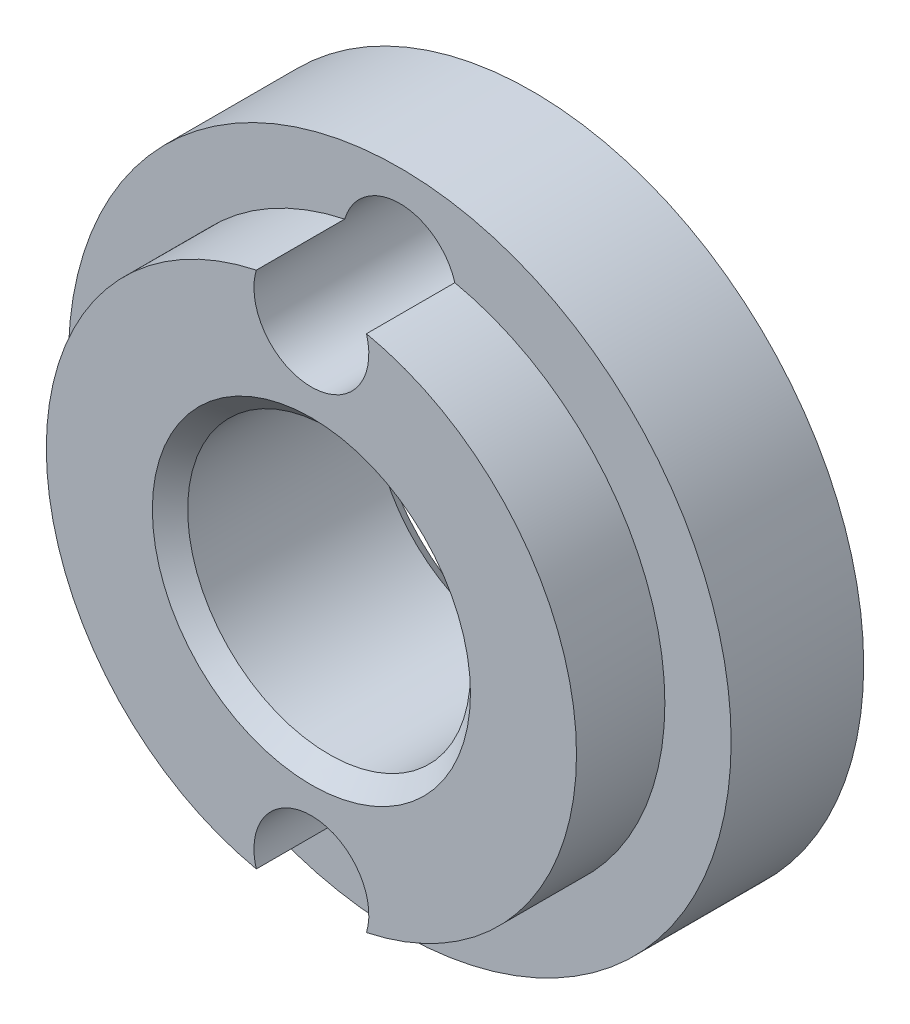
ISO-10303-21;
HEADER;
FILE_DESCRIPTION(('STEP AP214'),'2;1');
FILE_NAME('part.step','',(''),(''),'','','');
FILE_SCHEMA(('AUTOMOTIVE_DESIGN { 1 0 10303 214 1 1 1 1 }'));
ENDSEC;
DATA;
#1=APPLICATION_CONTEXT('core data for automotive mechanical design processes');
#2=APPLICATION_PROTOCOL_DEFINITION('international standard','automotive_design',2000,#1);
#3=PRODUCT_CONTEXT('',#1,'mechanical');
#4=PRODUCT('Part','Part','',(#3));
#5=PRODUCT_RELATED_PRODUCT_CATEGORY('part','',(#4));
#6=PRODUCT_DEFINITION_FORMATION('','',#4);
#7=PRODUCT_DEFINITION_CONTEXT('part definition',#1,'design');
#8=PRODUCT_DEFINITION('design','',#6,#7);
#9=PRODUCT_DEFINITION_SHAPE('','',#8);
#10=(LENGTH_UNIT() NAMED_UNIT(*) SI_UNIT(.MILLI.,.METRE.));
#11=(NAMED_UNIT(*) PLANE_ANGLE_UNIT() SI_UNIT($,.RADIAN.));
#12=(NAMED_UNIT(*) SI_UNIT($,.STERADIAN.) SOLID_ANGLE_UNIT());
#13=UNCERTAINTY_MEASURE_WITH_UNIT(LENGTH_MEASURE(1.E-05),#10,'distance_accuracy_value','');
#14=(GEOMETRIC_REPRESENTATION_CONTEXT(3) GLOBAL_UNCERTAINTY_ASSIGNED_CONTEXT((#13)) GLOBAL_UNIT_ASSIGNED_CONTEXT((#10,
#11,#12)) REPRESENTATION_CONTEXT('',''));
#15=CARTESIAN_POINT('',(0.,0.,0.));
#16=DIRECTION('',(0.,0.,1.));
#17=DIRECTION('',(1.,0.,0.));
#18=AXIS2_PLACEMENT_3D('',#15,#16,#17);
#19=CARTESIAN_POINT('',(0.,0.,4.99999999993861));
#20=DIRECTION('',(0.,0.,1.));
#21=DIRECTION('',(1.,0.,0.));
#22=AXIS2_PLACEMENT_3D('',#19,#20,#21);
#23=CONICAL_SURFACE('',#22,3.59999999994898,0.785398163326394);
#24=CARTESIAN_POINT('',(0.,0.,4.59999999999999));
#25=DIRECTION('',(0.,0.,1.));
#26=DIRECTION('',(1.,0.,0.));
#27=AXIS2_PLACEMENT_3D('',#24,#25,#26);
#28=CIRCLE('',#27,3.2);
#29=CARTESIAN_POINT('',(3.2,0.,4.59999999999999));
#30=VERTEX_POINT('',#29);
#31=EDGE_CURVE('E88',#30,#30,#28,.F.);
#32=ORIENTED_EDGE('',*,*,#31,.T.);
#33=EDGE_LOOP('',(#32));
#34=FACE_BOUND('',#33,.T.);
#35=CARTESIAN_POINT('',(0.,0.,4.99999999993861));
#36=DIRECTION('',(0.,0.,1.));
#37=DIRECTION('',(1.,0.,0.));
#38=AXIS2_PLACEMENT_3D('',#35,#36,#37);
#39=CIRCLE('',#38,3.59999999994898);
#40=CARTESIAN_POINT('',(3.59999999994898,0.,4.99999999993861));
#41=VERTEX_POINT('',#40);
#42=EDGE_CURVE('E19',#41,#41,#39,.F.);
#43=ORIENTED_EDGE('',*,*,#42,.F.);
#44=EDGE_LOOP('',(#43));
#45=FACE_BOUND('',#44,.T.);
#46=ADVANCED_FACE('F16',(#34,#45),#23,.F.);
#47=CARTESIAN_POINT('',(0.,0.,5.));
#48=DIRECTION('',(0.,0.,1.));
#49=DIRECTION('',(1.,0.,0.));
#50=AXIS2_PLACEMENT_3D('',#47,#48,#49);
#51=CYLINDRICAL_SURFACE('',#50,6.);
#52=CARTESIAN_POINT('',(0.,0.,5.));
#53=DIRECTION('',(0.,0.,1.));
#54=DIRECTION('',(1.,0.,0.));
#55=AXIS2_PLACEMENT_3D('',#52,#53,#54);
#56=CIRCLE('',#55,6.);
#57=CARTESIAN_POINT('',(1.24650387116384,-5.86909090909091,5.));
#58=VERTEX_POINT('',#57);
#59=CARTESIAN_POINT('',(1.24650387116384,5.86909090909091,5.));
#60=VERTEX_POINT('',#59);
#61=EDGE_CURVE('E76',#58,#60,#56,.T.);
#62=ORIENTED_EDGE('',*,*,#61,.F.);
#63=DIRECTION('',(0.,0.,-1.));
#64=VECTOR('',#63,1.);
#65=CARTESIAN_POINT('',(1.24650387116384,-5.86909090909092,6.070174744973));
#66=LINE('',#65,#64);
#67=CARTESIAN_POINT('',(1.24650387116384,-5.86909090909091,3.));
#68=VERTEX_POINT('',#67);
#69=EDGE_CURVE('E69',#58,#68,#66,.T.);
#70=ORIENTED_EDGE('',*,*,#69,.T.);
#71=CARTESIAN_POINT('',(0.,0.,3.));
#72=DIRECTION('',(0.,0.,1.));
#73=DIRECTION('',(1.,0.,0.));
#74=AXIS2_PLACEMENT_3D('',#71,#72,#73);
#75=CIRCLE('',#74,6.);
#76=CARTESIAN_POINT('',(1.24650387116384,5.86909090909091,3.));
#77=VERTEX_POINT('',#76);
#78=EDGE_CURVE('E54',#77,#68,#75,.F.);
#79=ORIENTED_EDGE('',*,*,#78,.F.);
#80=DIRECTION('',(0.,0.,-1.));
#81=VECTOR('',#80,1.);
#82=CARTESIAN_POINT('',(1.24650387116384,5.86909090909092,6.070174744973));
#83=LINE('',#82,#81);
#84=EDGE_CURVE('E79',#77,#60,#83,.F.);
#85=ORIENTED_EDGE('',*,*,#84,.T.);
#86=EDGE_LOOP('',(#62,#70,#79,#85));
#87=FACE_BOUND('',#86,.T.);
#88=ADVANCED_FACE('F74',(#87),#51,.T.);
#89=CARTESIAN_POINT('',(0.,0.,5.));
#90=DIRECTION('',(0.,0.,1.));
#91=DIRECTION('',(1.,0.,0.));
#92=AXIS2_PLACEMENT_3D('',#89,#90,#91);
#93=CYLINDRICAL_SURFACE('',#92,6.);
#94=CARTESIAN_POINT('',(0.,0.,3.));
#95=DIRECTION('',(0.,0.,1.));
#96=DIRECTION('',(1.,0.,0.));
#97=AXIS2_PLACEMENT_3D('',#94,#95,#96);
#98=CIRCLE('',#97,6.);
#99=CARTESIAN_POINT('',(-1.24650387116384,-5.86909090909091,3.));
#100=VERTEX_POINT('',#99);
#101=CARTESIAN_POINT('',(-1.24650387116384,5.86909090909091,3.));
#102=VERTEX_POINT('',#101);
#103=EDGE_CURVE('E65',#100,#102,#98,.F.);
#104=ORIENTED_EDGE('',*,*,#103,.F.);
#105=DIRECTION('',(0.,0.,-1.));
#106=VECTOR('',#105,1.);
#107=CARTESIAN_POINT('',(-1.24650387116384,-5.86909090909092,6.070174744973));
#108=LINE('',#107,#106);
#109=CARTESIAN_POINT('',(-1.24650387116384,-5.86909090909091,5.));
#110=VERTEX_POINT('',#109);
#111=EDGE_CURVE('E72',#100,#110,#108,.F.);
#112=ORIENTED_EDGE('',*,*,#111,.T.);
#113=CARTESIAN_POINT('',(0.,0.,5.));
#114=DIRECTION('',(0.,0.,1.));
#115=DIRECTION('',(1.,0.,0.));
#116=AXIS2_PLACEMENT_3D('',#113,#114,#115);
#117=CIRCLE('',#116,6.);
#118=CARTESIAN_POINT('',(-1.24650387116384,5.86909090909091,5.));
#119=VERTEX_POINT('',#118);
#120=EDGE_CURVE('E105',#119,#110,#117,.T.);
#121=ORIENTED_EDGE('',*,*,#120,.F.);
#122=DIRECTION('',(0.,0.,-1.));
#123=VECTOR('',#122,1.);
#124=CARTESIAN_POINT('',(-1.24650387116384,5.86909090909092,6.070174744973));
#125=LINE('',#124,#123);
#126=EDGE_CURVE('E64',#119,#102,#125,.T.);
#127=ORIENTED_EDGE('',*,*,#126,.T.);
#128=EDGE_LOOP('',(#104,#112,#121,#127));
#129=FACE_BOUND('',#128,.T.);
#130=ADVANCED_FACE('F119',(#129),#93,.T.);
#131=CARTESIAN_POINT('',(0.,0.,5.));
#132=DIRECTION('',(0.,0.,1.));
#133=DIRECTION('',(1.,0.,0.));
#134=AXIS2_PLACEMENT_3D('',#131,#132,#133);
#135=PLANE('',#134);
#136=CARTESIAN_POINT('',(0.,-5.5,5.));
#137=DIRECTION('',(0.,0.,-1.));
#138=DIRECTION('',(-1.,0.,0.));
#139=AXIS2_PLACEMENT_3D('',#136,#137,#138);
#140=CIRCLE('',#139,1.3);
#141=EDGE_CURVE('E33',#110,#58,#140,.T.);
#142=ORIENTED_EDGE('',*,*,#141,.T.);
#143=ORIENTED_EDGE('',*,*,#61,.T.);
#144=CARTESIAN_POINT('',(0.,5.5,5.));
#145=DIRECTION('',(0.,0.,-1.));
#146=DIRECTION('',(-1.,0.,0.));
#147=AXIS2_PLACEMENT_3D('',#144,#145,#146);
#148=CIRCLE('',#147,1.3);
#149=EDGE_CURVE('E77',#60,#119,#148,.T.);
#150=ORIENTED_EDGE('',*,*,#149,.T.);
#151=ORIENTED_EDGE('',*,*,#120,.T.);
#152=EDGE_LOOP('',(#142,#143,#150,#151));
#153=FACE_BOUND('',#152,.T.);
#154=ORIENTED_EDGE('',*,*,#42,.T.);
#155=EDGE_LOOP('',(#154));
#156=FACE_BOUND('',#155,.T.);
#157=ADVANCED_FACE('F111',(#153,#156),#135,.T.);
#158=CARTESIAN_POINT('',(0.,0.,0.));
#159=DIRECTION('',(0.,0.,1.));
#160=DIRECTION('',(1.,0.,0.));
#161=AXIS2_PLACEMENT_3D('',#158,#159,#160);
#162=CYLINDRICAL_SURFACE('',#161,3.2);
#163=CARTESIAN_POINT('',(0.,0.,0.400000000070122));
#164=DIRECTION('',(0.,0.,-1.));
#165=DIRECTION('',(-1.,0.,0.));
#166=AXIS2_PLACEMENT_3D('',#163,#164,#165);
#167=CIRCLE('',#166,3.20000000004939);
#168=CARTESIAN_POINT('',(-3.20000000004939,0.,0.400000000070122));
#169=VERTEX_POINT('',#168);
#170=EDGE_CURVE('E83',#169,#169,#167,.T.);
#171=ORIENTED_EDGE('',*,*,#170,.T.);
#172=EDGE_LOOP('',(#171));
#173=FACE_BOUND('',#172,.T.);
#174=ORIENTED_EDGE('',*,*,#31,.F.);
#175=EDGE_LOOP('',(#174));
#176=FACE_BOUND('',#175,.T.);
#177=ADVANCED_FACE('F145',(#173,#176),#162,.F.);
#178=CARTESIAN_POINT('',(0.,0.,3.));
#179=DIRECTION('',(0.,0.,1.));
#180=DIRECTION('',(1.,0.,0.));
#181=AXIS2_PLACEMENT_3D('',#178,#179,#180);
#182=PLANE('',#181);
#183=CARTESIAN_POINT('',(0.,0.,3.));
#184=DIRECTION('',(0.,0.,1.));
#185=DIRECTION('',(1.,0.,0.));
#186=AXIS2_PLACEMENT_3D('',#183,#184,#185);
#187=CIRCLE('',#186,7.5);
#188=CARTESIAN_POINT('',(7.5,0.,3.));
#189=VERTEX_POINT('',#188);
#190=EDGE_CURVE('E99',#189,#189,#187,.F.);
#191=ORIENTED_EDGE('',*,*,#190,.F.);
#192=EDGE_LOOP('',(#191));
#193=FACE_BOUND('',#192,.T.);
#194=ORIENTED_EDGE('',*,*,#78,.T.);
#195=CARTESIAN_POINT('',(0.,-5.5,3.));
#196=DIRECTION('',(0.,0.,-1.));
#197=DIRECTION('',(-1.,0.,0.));
#198=AXIS2_PLACEMENT_3D('',#195,#196,#197);
#199=CIRCLE('',#198,1.3);
#200=EDGE_CURVE('E57',#68,#100,#199,.T.);
#201=ORIENTED_EDGE('',*,*,#200,.T.);
#202=ORIENTED_EDGE('',*,*,#103,.T.);
#203=CARTESIAN_POINT('',(0.,5.5,3.));
#204=DIRECTION('',(0.,0.,-1.));
#205=DIRECTION('',(-1.,0.,0.));
#206=AXIS2_PLACEMENT_3D('',#203,#204,#205);
#207=CIRCLE('',#206,1.3);
#208=EDGE_CURVE('E59',#102,#77,#207,.T.);
#209=ORIENTED_EDGE('',*,*,#208,.T.);
#210=EDGE_LOOP('',(#194,#201,#202,#209));
#211=FACE_BOUND('',#210,.T.);
#212=ADVANCED_FACE('F56',(#193,#211),#182,.T.);
#213=CARTESIAN_POINT('',(0.,5.5,6.070174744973));
#214=DIRECTION('',(0.,0.,-1.));
#215=DIRECTION('',(-1.,0.,0.));
#216=AXIS2_PLACEMENT_3D('',#213,#214,#215);
#217=CYLINDRICAL_SURFACE('',#216,1.3);
#218=ORIENTED_EDGE('',*,*,#126,.F.);
#219=ORIENTED_EDGE('',*,*,#149,.F.);
#220=ORIENTED_EDGE('',*,*,#84,.F.);
#221=ORIENTED_EDGE('',*,*,#208,.F.);
#222=EDGE_LOOP('',(#218,#219,#220,#221));
#223=FACE_BOUND('',#222,.T.);
#224=CARTESIAN_POINT('',(0.,5.5,0.));
#225=DIRECTION('',(0.,0.,-1.));
#226=DIRECTION('',(-1.,0.,0.));
#227=AXIS2_PLACEMENT_3D('',#224,#225,#226);
#228=CIRCLE('',#227,1.3);
#229=CARTESIAN_POINT('',(-1.3,5.5,0.));
#230=VERTEX_POINT('',#229);
#231=EDGE_CURVE('E96',#230,#230,#228,.T.);
#232=ORIENTED_EDGE('',*,*,#231,.T.);
#233=EDGE_LOOP('',(#232));
#234=FACE_BOUND('',#233,.T.);
#235=ADVANCED_FACE('F139',(#223,#234),#217,.F.);
#236=CARTESIAN_POINT('',(0.,-5.5,6.070174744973));
#237=DIRECTION('',(0.,0.,-1.));
#238=DIRECTION('',(-1.,0.,0.));
#239=AXIS2_PLACEMENT_3D('',#236,#237,#238);
#240=CYLINDRICAL_SURFACE('',#239,1.3);
#241=ORIENTED_EDGE('',*,*,#141,.F.);
#242=ORIENTED_EDGE('',*,*,#111,.F.);
#243=ORIENTED_EDGE('',*,*,#200,.F.);
#244=ORIENTED_EDGE('',*,*,#69,.F.);
#245=EDGE_LOOP('',(#241,#242,#243,#244));
#246=FACE_BOUND('',#245,.T.);
#247=CARTESIAN_POINT('',(0.,-5.5,0.));
#248=DIRECTION('',(0.,0.,-1.));
#249=DIRECTION('',(-1.,0.,0.));
#250=AXIS2_PLACEMENT_3D('',#247,#248,#249);
#251=CIRCLE('',#250,1.3);
#252=CARTESIAN_POINT('',(-1.3,-5.5,0.));
#253=VERTEX_POINT('',#252);
#254=EDGE_CURVE('E93',#253,#253,#251,.T.);
#255=ORIENTED_EDGE('',*,*,#254,.T.);
#256=EDGE_LOOP('',(#255));
#257=FACE_BOUND('',#256,.T.);
#258=ADVANCED_FACE('F67',(#246,#257),#240,.F.);
#259=CARTESIAN_POINT('',(0.,0.,1.70530256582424E-10));
#260=DIRECTION('',(0.,0.,-1.));
#261=DIRECTION('',(-1.,0.,0.));
#262=AXIS2_PLACEMENT_3D('',#259,#260,#261);
#263=CONICAL_SURFACE('',#262,3.60000000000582,0.785398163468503);
#264=ORIENTED_EDGE('',*,*,#170,.F.);
#265=EDGE_LOOP('',(#264));
#266=FACE_BOUND('',#265,.T.);
#267=CARTESIAN_POINT('',(0.,0.,1.13686837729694E-10));
#268=DIRECTION('',(0.,0.,-1.));
#269=DIRECTION('',(-1.,0.,0.));
#270=AXIS2_PLACEMENT_3D('',#267,#268,#269);
#271=CIRCLE('',#270,3.60000000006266);
#272=CARTESIAN_POINT('',(-3.60000000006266,0.,1.13686837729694E-10));
#273=VERTEX_POINT('',#272);
#274=EDGE_CURVE('E25',#273,#273,#271,.T.);
#275=ORIENTED_EDGE('',*,*,#274,.T.);
#276=EDGE_LOOP('',(#275));
#277=FACE_BOUND('',#276,.T.);
#278=ADVANCED_FACE('F128',(#266,#277),#263,.F.);
#279=CARTESIAN_POINT('',(0.,0.,0.));
#280=DIRECTION('',(0.,0.,1.));
#281=DIRECTION('',(1.,0.,0.));
#282=AXIS2_PLACEMENT_3D('',#279,#280,#281);
#283=CYLINDRICAL_SURFACE('',#282,7.5);
#284=ORIENTED_EDGE('',*,*,#190,.T.);
#285=EDGE_LOOP('',(#284));
#286=FACE_BOUND('',#285,.T.);
#287=CARTESIAN_POINT('',(0.,0.,0.));
#288=DIRECTION('',(0.,0.,1.));
#289=DIRECTION('',(1.,0.,0.));
#290=AXIS2_PLACEMENT_3D('',#287,#288,#289);
#291=CIRCLE('',#290,7.5);
#292=CARTESIAN_POINT('',(7.5,0.,0.));
#293=VERTEX_POINT('',#292);
#294=EDGE_CURVE('E11',#293,#293,#291,.T.);
#295=ORIENTED_EDGE('',*,*,#294,.T.);
#296=EDGE_LOOP('',(#295));
#297=FACE_BOUND('',#296,.T.);
#298=ADVANCED_FACE('F122',(#286,#297),#283,.T.);
#299=CARTESIAN_POINT('',(0.,0.,0.));
#300=DIRECTION('',(0.,0.,1.));
#301=DIRECTION('',(1.,0.,0.));
#302=AXIS2_PLACEMENT_3D('',#299,#300,#301);
#303=PLANE('',#302);
#304=ORIENTED_EDGE('',*,*,#294,.F.);
#305=EDGE_LOOP('',(#304));
#306=FACE_BOUND('',#305,.T.);
#307=ORIENTED_EDGE('',*,*,#274,.F.);
#308=EDGE_LOOP('',(#307));
#309=FACE_BOUND('',#308,.T.);
#310=ORIENTED_EDGE('',*,*,#254,.F.);
#311=EDGE_LOOP('',(#310));
#312=FACE_BOUND('',#311,.T.);
#313=ORIENTED_EDGE('',*,*,#231,.F.);
#314=EDGE_LOOP('',(#313));
#315=FACE_BOUND('',#314,.T.);
#316=ADVANCED_FACE('F120',(#306,#309,#312,#315),#303,.F.);
#317=CLOSED_SHELL('',(#46,#88,#130,#157,#177,#212,#235,#258,#278,#298,#316));
#318=MANIFOLD_SOLID_BREP('B1',#317);
#319=ADVANCED_BREP_SHAPE_REPRESENTATION('',(#18,#318),#14);
#320=SHAPE_DEFINITION_REPRESENTATION(#9,#319);
ENDSEC;
END-ISO-10303-21;
